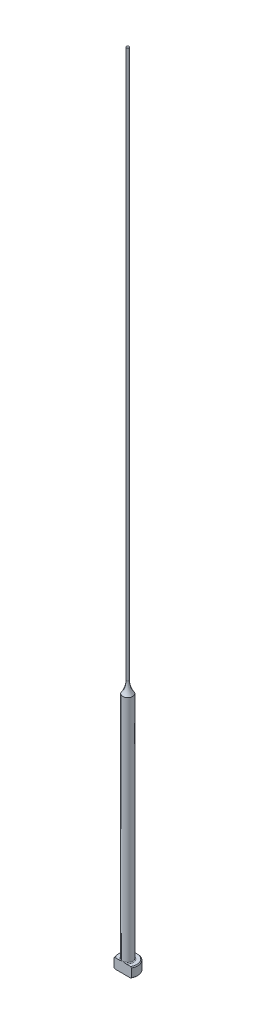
ISO-10303-21;
HEADER;
FILE_DESCRIPTION(('STEP AP214'),'2;1');
FILE_NAME('part.step','',(''),(''),'','','');
FILE_SCHEMA(('AUTOMOTIVE_DESIGN { 1 0 10303 214 1 1 1 1 }'));
ENDSEC;
DATA;
#1=APPLICATION_CONTEXT('core data for automotive mechanical design processes');
#2=APPLICATION_PROTOCOL_DEFINITION('international standard','automotive_design',2000,#1);
#3=PRODUCT_CONTEXT('',#1,'mechanical');
#4=PRODUCT('Part','Part','',(#3));
#5=PRODUCT_RELATED_PRODUCT_CATEGORY('part','',(#4));
#6=PRODUCT_DEFINITION_FORMATION('','',#4);
#7=PRODUCT_DEFINITION_CONTEXT('part definition',#1,'design');
#8=PRODUCT_DEFINITION('design','',#6,#7);
#9=PRODUCT_DEFINITION_SHAPE('','',#8);
#10=(LENGTH_UNIT() NAMED_UNIT(*) SI_UNIT(.MILLI.,.METRE.));
#11=(NAMED_UNIT(*) PLANE_ANGLE_UNIT() SI_UNIT($,.RADIAN.));
#12=(NAMED_UNIT(*) SI_UNIT($,.STERADIAN.) SOLID_ANGLE_UNIT());
#13=UNCERTAINTY_MEASURE_WITH_UNIT(LENGTH_MEASURE(1.E-05),#10,'distance_accuracy_value','');
#14=(GEOMETRIC_REPRESENTATION_CONTEXT(3) GLOBAL_UNCERTAINTY_ASSIGNED_CONTEXT((#13)) GLOBAL_UNIT_ASSIGNED_CONTEXT((#10,
#11,#12)) REPRESENTATION_CONTEXT('',''));
#15=CARTESIAN_POINT('',(0.,0.,0.));
#16=DIRECTION('',(0.,0.,1.));
#17=DIRECTION('',(1.,0.,0.));
#18=AXIS2_PLACEMENT_3D('',#15,#16,#17);
#19=CARTESIAN_POINT('',(-0.396239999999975,254.,0.));
#20=DIRECTION('',(0.,1.,0.));
#21=DIRECTION('',(0.,0.,1.));
#22=AXIS2_PLACEMENT_3D('',#19,#20,#21);
#23=PLANE('',#22);
#24=CARTESIAN_POINT('',(0.,254.,0.));
#25=DIRECTION('',(0.,1.,0.));
#26=DIRECTION('',(0.,0.,1.));
#27=AXIS2_PLACEMENT_3D('',#24,#25,#26);
#28=CIRCLE('',#27,0.396239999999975);
#29=CARTESIAN_POINT('',(0.,254.,0.396239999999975));
#30=VERTEX_POINT('',#29);
#31=EDGE_CURVE('E169',#30,#30,#28,.T.);
#32=ORIENTED_EDGE('',*,*,#31,.T.);
#33=EDGE_LOOP('',(#32));
#34=FACE_BOUND('',#33,.T.);
#35=ADVANCED_FACE('F37',(#34),#23,.T.);
#36=CARTESIAN_POINT('',(0.,259.958771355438,0.));
#37=DIRECTION('',(0.,1.,0.));
#38=DIRECTION('',(0.,0.,1.));
#39=AXIS2_PLACEMENT_3D('',#36,#37,#38);
#40=CYLINDRICAL_SURFACE('',#39,0.396239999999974);
#41=CARTESIAN_POINT('',(0.,79.9026884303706,0.));
#42=DIRECTION('',(0.,1.,0.));
#43=DIRECTION('',(0.,0.,1.));
#44=AXIS2_PLACEMENT_3D('',#41,#42,#43);
#45=CIRCLE('',#44,0.396239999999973);
#46=CARTESIAN_POINT('',(0.,79.9026884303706,0.396239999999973));
#47=VERTEX_POINT('',#46);
#48=EDGE_CURVE('E172',#47,#47,#45,.T.);
#49=ORIENTED_EDGE('',*,*,#48,.T.);
#50=EDGE_LOOP('',(#49));
#51=FACE_BOUND('',#50,.T.);
#52=ORIENTED_EDGE('',*,*,#31,.F.);
#53=EDGE_LOOP('',(#52));
#54=FACE_BOUND('',#53,.T.);
#55=ADVANCED_FACE('F160',(#51,#54),#40,.T.);
#56=CARTESIAN_POINT('',(0.,79.9026884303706,0.));
#57=DIRECTION('',(0.,1.,0.));
#58=DIRECTION('',(0.,0.,1.));
#59=AXIS2_PLACEMENT_3D('',#56,#57,#58);
#60=TOROIDAL_SURFACE('',#59,6.74623999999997,6.35);
#61=CARTESIAN_POINT('',(0.,76.2,0.));
#62=DIRECTION('',(0.,1.,0.));
#63=DIRECTION('',(0.,0.,1.));
#64=AXIS2_PLACEMENT_3D('',#61,#62,#63);
#65=CIRCLE('',#64,1.58749999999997);
#66=CARTESIAN_POINT('',(0.,76.2,1.58749999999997));
#67=VERTEX_POINT('',#66);
#68=EDGE_CURVE('E100',#67,#67,#65,.T.);
#69=ORIENTED_EDGE('',*,*,#68,.T.);
#70=EDGE_LOOP('',(#69));
#71=FACE_BOUND('',#70,.T.);
#72=ORIENTED_EDGE('',*,*,#48,.F.);
#73=EDGE_LOOP('',(#72));
#74=FACE_BOUND('',#73,.T.);
#75=ADVANCED_FACE('F165',(#71,#74),#60,.F.);
#76=CARTESIAN_POINT('',(0.,259.958771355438,0.));
#77=DIRECTION('',(0.,1.,0.));
#78=DIRECTION('',(0.,0.,1.));
#79=AXIS2_PLACEMENT_3D('',#76,#77,#78);
#80=CYLINDRICAL_SURFACE('',#79,1.58749999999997);
#81=CARTESIAN_POINT('',(0.,3.42900000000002,0.));
#82=DIRECTION('',(0.,1.,0.));
#83=DIRECTION('',(0.,0.,1.));
#84=AXIS2_PLACEMENT_3D('',#81,#82,#83);
#85=CIRCLE('',#84,1.58749999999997);
#86=CARTESIAN_POINT('',(0.,3.42900000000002,1.58749999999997));
#87=VERTEX_POINT('',#86);
#88=EDGE_CURVE('E109',#87,#87,#85,.T.);
#89=ORIENTED_EDGE('',*,*,#88,.T.);
#90=EDGE_LOOP('',(#89));
#91=FACE_BOUND('',#90,.T.);
#92=ORIENTED_EDGE('',*,*,#68,.F.);
#93=EDGE_LOOP('',(#92));
#94=FACE_BOUND('',#93,.T.);
#95=ADVANCED_FACE('F192',(#91,#94),#80,.T.);
#96=CARTESIAN_POINT('',(-3.17499999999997,3.175,0.));
#97=DIRECTION('',(0.,1.,0.));
#98=DIRECTION('',(0.,0.,1.));
#99=AXIS2_PLACEMENT_3D('',#96,#97,#98);
#100=PLANE('',#99);
#101=DIRECTION('',(-1.,0.,0.));
#102=VECTOR('',#101,1.);
#103=CARTESIAN_POINT('',(-3.17499999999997,3.175,1.58749999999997));
#104=LINE('',#103,#102);
#105=CARTESIAN_POINT('',(2.45195529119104,3.175,1.58749999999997));
#106=VERTEX_POINT('',#105);
#107=CARTESIAN_POINT('',(0.933255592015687,3.175,1.58749999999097));
#108=VERTEX_POINT('',#107);
#109=EDGE_CURVE('E58',#106,#108,#104,.T.);
#110=ORIENTED_EDGE('',*,*,#109,.F.);
#111=CARTESIAN_POINT('',(0.,3.175,0.));
#112=DIRECTION('',(0.,1.,0.));
#113=DIRECTION('',(0.,0.,1.));
#114=AXIS2_PLACEMENT_3D('',#111,#112,#113);
#115=CIRCLE('',#114,2.92099999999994);
#116=CARTESIAN_POINT('',(-2.45195529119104,3.175,1.58749999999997));
#117=VERTEX_POINT('',#116);
#118=EDGE_CURVE('E171',#106,#117,#115,.T.);
#119=ORIENTED_EDGE('',*,*,#118,.T.);
#120=CARTESIAN_POINT('',(-0.933255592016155,3.17500000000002,1.58749999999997));
#121=VERTEX_POINT('',#120);
#122=EDGE_CURVE('E140',#121,#117,#104,.T.);
#123=ORIENTED_EDGE('',*,*,#122,.F.);
#124=CARTESIAN_POINT('',(0.,3.175,0.));
#125=DIRECTION('',(0.,1.,0.));
#126=DIRECTION('',(0.,0.,1.));
#127=AXIS2_PLACEMENT_3D('',#124,#125,#126);
#128=CIRCLE('',#127,1.84149999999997);
#129=EDGE_CURVE('E113',#121,#108,#128,.F.);
#130=ORIENTED_EDGE('',*,*,#129,.T.);
#131=EDGE_LOOP('',(#110,#119,#123,#130));
#132=FACE_BOUND('',#131,.T.);
#133=ADVANCED_FACE('F189',(#132),#100,.T.);
#134=CARTESIAN_POINT('',(0.,259.958771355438,0.));
#135=DIRECTION('',(0.,1.,0.));
#136=DIRECTION('',(0.,0.,1.));
#137=AXIS2_PLACEMENT_3D('',#134,#135,#136);
#138=CYLINDRICAL_SURFACE('',#137,3.17499999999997);
#139=DIRECTION('',(0.,-1.,0.));
#140=VECTOR('',#139,1.);
#141=CARTESIAN_POINT('',(-2.74963065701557,254.,1.58749999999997));
#142=LINE('',#141,#140);
#143=CARTESIAN_POINT('',(-2.74963065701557,2.92100000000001,1.58749999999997));
#144=VERTEX_POINT('',#143);
#145=CARTESIAN_POINT('',(-2.74963065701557,0.253999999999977,1.58749999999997));
#146=VERTEX_POINT('',#145);
#147=EDGE_CURVE('E95',#144,#146,#142,.T.);
#148=ORIENTED_EDGE('',*,*,#147,.F.);
#149=CARTESIAN_POINT('',(0.,2.92100000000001,0.));
#150=DIRECTION('',(0.,1.,0.));
#151=DIRECTION('',(0.,0.,1.));
#152=AXIS2_PLACEMENT_3D('',#149,#150,#151);
#153=CIRCLE('',#152,3.17499999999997);
#154=CARTESIAN_POINT('',(2.74963065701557,2.92100000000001,1.58749999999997));
#155=VERTEX_POINT('',#154);
#156=EDGE_CURVE('E110',#144,#155,#153,.F.);
#157=ORIENTED_EDGE('',*,*,#156,.T.);
#158=DIRECTION('',(0.,-1.,0.));
#159=VECTOR('',#158,1.);
#160=CARTESIAN_POINT('',(2.74963065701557,254.,1.58749999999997));
#161=LINE('',#160,#159);
#162=CARTESIAN_POINT('',(2.74963065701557,0.253999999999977,1.58749999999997));
#163=VERTEX_POINT('',#162);
#164=EDGE_CURVE('E182',#155,#163,#161,.T.);
#165=ORIENTED_EDGE('',*,*,#164,.T.);
#166=CARTESIAN_POINT('',(0.,0.253999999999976,0.));
#167=DIRECTION('',(0.,-1.,0.));
#168=DIRECTION('',(0.,0.,-1.));
#169=AXIS2_PLACEMENT_3D('',#166,#167,#168);
#170=CIRCLE('',#169,3.17499999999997);
#171=EDGE_CURVE('E116',#163,#146,#170,.F.);
#172=ORIENTED_EDGE('',*,*,#171,.T.);
#173=EDGE_LOOP('',(#148,#157,#165,#172));
#174=FACE_BOUND('',#173,.T.);
#175=ADVANCED_FACE('F180',(#174),#138,.T.);
#176=CARTESIAN_POINT('',(0.,0.,0.));
#177=DIRECTION('',(0.,-1.,0.));
#178=DIRECTION('',(0.,0.,-1.));
#179=AXIS2_PLACEMENT_3D('',#176,#177,#178);
#180=PLANE('',#179);
#181=DIRECTION('',(1.,0.,0.));
#182=VECTOR('',#181,1.);
#183=CARTESIAN_POINT('',(-2.74963065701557,0.,1.58749999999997));
#184=LINE('',#183,#182);
#185=CARTESIAN_POINT('',(-2.45195529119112,0.,1.58749999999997));
#186=VERTEX_POINT('',#185);
#187=CARTESIAN_POINT('',(2.45195529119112,0.,1.58749999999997));
#188=VERTEX_POINT('',#187);
#189=EDGE_CURVE('E92',#186,#188,#184,.T.);
#190=ORIENTED_EDGE('',*,*,#189,.F.);
#191=CARTESIAN_POINT('',(0.,0.,0.));
#192=DIRECTION('',(0.,-1.,0.));
#193=DIRECTION('',(0.,0.,-1.));
#194=AXIS2_PLACEMENT_3D('',#191,#192,#193);
#195=CIRCLE('',#194,2.92100000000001);
#196=EDGE_CURVE('E106',#186,#188,#195,.T.);
#197=ORIENTED_EDGE('',*,*,#196,.T.);
#198=EDGE_LOOP('',(#190,#197));
#199=FACE_BOUND('',#198,.T.);
#200=ADVANCED_FACE('F105',(#199),#180,.T.);
#201=CARTESIAN_POINT('',(0.,3.17499999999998,0.));
#202=DIRECTION('',(0.,-1.,0.));
#203=DIRECTION('',(0.,0.,-1.));
#204=AXIS2_PLACEMENT_3D('',#201,#202,#203);
#205=CONICAL_SURFACE('',#204,2.92099999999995,0.785398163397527);
#206=CARTESIAN_POINT('',(6.0529050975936,-0.16162066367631,1.58749999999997));
#207=CARTESIAN_POINT('',(5.91567682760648,-0.0288893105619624,1.58749999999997));
#208=CARTESIAN_POINT('',(5.7783103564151,0.103699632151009,1.58749999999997));
#209=CARTESIAN_POINT('',(5.50321874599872,0.368508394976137,1.58749999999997));
#210=CARTESIAN_POINT('',(5.36549360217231,0.500728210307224,1.58749999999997));
#211=CARTESIAN_POINT('',(5.08953516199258,0.764778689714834,1.58749999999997));
#212=CARTESIAN_POINT('',(4.9513016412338,0.896609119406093,1.58749999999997));
#213=CARTESIAN_POINT('',(4.67428233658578,1.15968706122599,1.58749999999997));
#214=CARTESIAN_POINT('',(4.53549655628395,1.29093457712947,1.58749999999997));
#215=CARTESIAN_POINT('',(4.25997724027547,1.55007705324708,1.58749999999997));
#216=CARTESIAN_POINT('',(4.12325766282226,1.67798684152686,1.58749999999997));
#217=CARTESIAN_POINT('',(3.84892898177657,1.9328486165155,1.58749999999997));
#218=CARTESIAN_POINT('',(3.71131988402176,2.05980060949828,1.58749999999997));
#219=CARTESIAN_POINT('',(3.43493978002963,2.31237508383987,1.58749999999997));
#220=CARTESIAN_POINT('',(3.29616903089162,2.43799784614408,1.58749999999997));
#221=CARTESIAN_POINT('',(3.01699558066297,2.68741369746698,1.58749999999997));
#222=CARTESIAN_POINT('',(2.8765929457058,2.81120686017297,1.58749999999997));
#223=CARTESIAN_POINT('',(2.64816703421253,3.00875865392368,1.58749999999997));
#224=CARTESIAN_POINT('',(2.56087478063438,3.08336151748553,1.58749999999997));
#225=CARTESIAN_POINT('',(2.38515423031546,3.23123871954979,1.58749999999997));
#226=CARTESIAN_POINT('',(2.29672582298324,3.30451292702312,1.58749999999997));
#227=CARTESIAN_POINT('',(2.11747400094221,3.45004422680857,1.58749999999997));
#228=CARTESIAN_POINT('',(2.02663514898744,3.5222823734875,1.58749999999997));
#229=CARTESIAN_POINT('',(1.8430252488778,3.66423097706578,1.58749999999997));
#230=CARTESIAN_POINT('',(1.75025467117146,3.73394203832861,1.58749999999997));
#231=CARTESIAN_POINT('',(1.56067475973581,3.87080633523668,1.58749999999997));
#232=CARTESIAN_POINT('',(1.46382547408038,3.93790459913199,1.58749999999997));
#233=CARTESIAN_POINT('',(1.26632594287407,4.06669147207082,1.58749999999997));
#234=CARTESIAN_POINT('',(1.16567073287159,4.1283726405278,1.58749999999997));
#235=CARTESIAN_POINT('',(1.01165766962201,4.21402252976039,1.58749999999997));
#236=CARTESIAN_POINT('',(0.960142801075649,4.24127929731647,1.58749999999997));
#237=CARTESIAN_POINT('',(0.855780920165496,4.2930979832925,1.58749999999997));
#238=CARTESIAN_POINT('',(0.80293366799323,4.31765941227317,1.58749999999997));
#239=CARTESIAN_POINT('',(0.642461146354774,4.38614656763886,1.58749999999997));
#240=CARTESIAN_POINT('',(0.532518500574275,4.42510149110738,1.58749999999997));
#241=CARTESIAN_POINT('',(0.367680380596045,4.46726244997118,1.58749999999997));
#242=CARTESIAN_POINT('',(0.31480288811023,4.47844427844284,1.58749999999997));
#243=CARTESIAN_POINT('',(0.208209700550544,4.49576654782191,1.58749999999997));
#244=CARTESIAN_POINT('',(0.154494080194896,4.50190743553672,1.58749999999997));
#245=CARTESIAN_POINT('',(0.0468792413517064,4.50871296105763,1.58749999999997));
#246=CARTESIAN_POINT('',(-0.0070188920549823,4.5093945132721,1.58749999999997));
#247=CARTESIAN_POINT('',(-0.114606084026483,4.50527679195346,1.58749999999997));
#248=CARTESIAN_POINT('',(-0.168295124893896,4.50047706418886,1.58749999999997));
#249=CARTESIAN_POINT('',(-0.274485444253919,4.48579689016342,1.58749999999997));
#250=CARTESIAN_POINT('',(-0.326992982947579,4.47596081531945,1.58749999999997));
#251=CARTESIAN_POINT('',(-0.430974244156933,4.45181809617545,1.58749999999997));
#252=CARTESIAN_POINT('',(-0.482447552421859,4.4375096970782,1.58749999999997));
#253=CARTESIAN_POINT('',(-0.584460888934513,4.40502489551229,1.58749999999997));
#254=CARTESIAN_POINT('',(-0.634994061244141,4.386827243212,1.58749999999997));
#255=CARTESIAN_POINT('',(-0.734789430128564,4.34729308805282,1.58749999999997));
#256=CARTESIAN_POINT('',(-0.784051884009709,4.3259572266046,1.58749999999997));
#257=CARTESIAN_POINT('',(-0.930549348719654,4.25791922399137,1.58749999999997));
#258=CARTESIAN_POINT('',(-1.0259880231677,4.20736047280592,1.58749999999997));
#259=CARTESIAN_POINT('',(-1.21304313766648,4.0995545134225,1.58749999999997));
#260=CARTESIAN_POINT('',(-1.30465471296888,4.04229912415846,1.58749999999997));
#261=CARTESIAN_POINT('',(-1.48526211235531,3.92308746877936,1.58749999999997));
#262=CARTESIAN_POINT('',(-1.57424615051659,3.86111349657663,1.58749999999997));
#263=CARTESIAN_POINT('',(-1.74990003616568,3.73408621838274,1.58749999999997));
#264=CARTESIAN_POINT('',(-1.83657099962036,3.66903444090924,1.58749999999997));
#265=CARTESIAN_POINT('',(-2.00931764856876,3.53583371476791,1.58749999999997));
#266=CARTESIAN_POINT('',(-2.09537048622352,3.46765527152,1.58749999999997));
#267=CARTESIAN_POINT('',(-2.26611736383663,3.32960643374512,1.58749999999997));
#268=CARTESIAN_POINT('',(-2.35081125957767,3.25973586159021,1.58749999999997));
#269=CARTESIAN_POINT('',(-2.60290121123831,3.04858139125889,1.58749999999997));
#270=CARTESIAN_POINT('',(-2.76872537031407,2.90542388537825,1.58749999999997));
#271=CARTESIAN_POINT('',(-3.06970913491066,2.64069522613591,1.58749999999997));
#272=CARTESIAN_POINT('',(-3.20528660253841,2.51959458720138,1.58749999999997));
#273=CARTESIAN_POINT('',(-3.47510321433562,2.27590400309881,1.58749999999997));
#274=CARTESIAN_POINT('',(-3.60934232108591,2.1533140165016,1.58749999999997));
#275=CARTESIAN_POINT('',(-3.87695374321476,1.90694239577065,1.58749999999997));
#276=CARTESIAN_POINT('',(-4.0103251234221,1.78315974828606,1.58749999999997));
#277=CARTESIAN_POINT('',(-4.27630880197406,1.53478104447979,1.58749999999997));
#278=CARTESIAN_POINT('',(-4.40892109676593,1.41018498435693,1.58749999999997));
#279=CARTESIAN_POINT('',(-4.79499418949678,1.0457468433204,1.58749999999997));
#280=CARTESIAN_POINT('',(-5.04767313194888,0.805076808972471,1.58749999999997));
#281=CARTESIAN_POINT('',(-5.42550911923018,0.443121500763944,1.58749999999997));
#282=CARTESIAN_POINT('',(-5.55118772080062,0.322378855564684,1.58749999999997));
#283=CARTESIAN_POINT('',(-5.80225207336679,0.0805914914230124,1.58749999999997));
#284=CARTESIAN_POINT('',(-5.92763782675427,-0.0404532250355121,1.58749999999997));
#285=CARTESIAN_POINT('',(-6.0529050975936,-0.161620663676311,1.58749999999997));
#286=B_SPLINE_CURVE_WITH_KNOTS('',3,(#206,#207,#208,#209,#210,#211,#212,#213,#214,#215,#216,
#217,#218,#219,#220,#221,#222,#223,#224,#225,#226,#227,#228,#229,#230,#231,#232,#233,#234,#235,
#236,#237,#238,#239,#240,#241,#242,#243,#244,#245,#246,#247,#248,#249,#250,#251,#252,#253,#254,
#255,#256,#257,#258,#259,#260,#261,#262,#263,#264,#265,#266,#267,#268,#269,#270,#271,#272,#273,
#274,#275,#276,#277,#278,#279,#280,#281,#282,#283,#284,#285),.UNSPECIFIED.,.F.,.F.,(4,2,2,2,2,2,
2,2,2,2,2,2,2,2,2,2,2,2,2,2,2,2,2,2,2,2,2,2,2,2,2,2,2,2,2,2,2,2,2,4),(0.,0.572750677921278,
1.14550874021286,1.71856057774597,2.29160869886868,2.85328006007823,3.4149477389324,
3.97649423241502,4.53801804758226,4.88249307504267,5.22700189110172,5.5751532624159,
5.92322081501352,6.27657800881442,6.63041319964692,6.80518126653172,6.9799810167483,
7.3282426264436,7.49018491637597,7.65211285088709,7.81353889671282,7.97497832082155,
8.13501929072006,8.29512313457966,8.45612518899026,8.61709438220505,8.94062993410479,
9.2645649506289,9.58978187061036,9.91483894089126,10.2441741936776,10.5735441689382,
11.2306812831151,11.7760337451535,12.3214014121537,12.8672825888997,13.4131663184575,
14.4600164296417,14.9828595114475,15.5056983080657),.UNSPECIFIED.);
#287=EDGE_CURVE('E63',#155,#106,#286,.T.);
#288=ORIENTED_EDGE('',*,*,#287,.F.);
#289=ORIENTED_EDGE('',*,*,#156,.F.);
#290=EDGE_CURVE('E133',#117,#144,#286,.T.);
#291=ORIENTED_EDGE('',*,*,#290,.F.);
#292=ORIENTED_EDGE('',*,*,#118,.F.);
#293=EDGE_LOOP('',(#288,#289,#291,#292));
#294=FACE_BOUND('',#293,.T.);
#295=ADVANCED_FACE('F147',(#294),#205,.T.);
#296=CARTESIAN_POINT('',(0.,0.253999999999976,0.));
#297=DIRECTION('',(0.,1.,0.));
#298=DIRECTION('',(0.,0.,1.));
#299=AXIS2_PLACEMENT_3D('',#296,#297,#298);
#300=CONICAL_SURFACE('',#299,3.17499999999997,0.785398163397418);
#301=CARTESIAN_POINT('',(-6.0529050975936,3.33662066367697,1.58749999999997));
#302=CARTESIAN_POINT('',(-5.91567682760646,3.20388931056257,1.58749999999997));
#303=CARTESIAN_POINT('',(-5.77831035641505,3.07130036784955,1.58749999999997));
#304=CARTESIAN_POINT('',(-5.50321874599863,2.80649160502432,1.58749999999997));
#305=CARTESIAN_POINT('',(-5.3654936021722,2.67427178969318,1.58749999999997));
#306=CARTESIAN_POINT('',(-5.08953516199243,2.41022131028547,1.58749999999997));
#307=CARTESIAN_POINT('',(-4.95130164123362,2.27839088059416,1.58749999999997));
#308=CARTESIAN_POINT('',(-4.67428233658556,2.01531293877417,1.58749999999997));
#309=CARTESIAN_POINT('',(-4.5354965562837,1.88406542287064,1.58749999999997));
#310=CARTESIAN_POINT('',(-4.25997724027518,1.62492294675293,1.58749999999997));
#311=CARTESIAN_POINT('',(-4.12325766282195,1.49701315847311,1.58749999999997));
#312=CARTESIAN_POINT('',(-3.84892898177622,1.24215138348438,1.58749999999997));
#313=CARTESIAN_POINT('',(-3.71131988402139,1.11519939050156,1.58749999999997));
#314=CARTESIAN_POINT('',(-3.43493978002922,0.862624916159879,1.58749999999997));
#315=CARTESIAN_POINT('',(-3.29616903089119,0.737002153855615,1.58749999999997));
#316=CARTESIAN_POINT('',(-3.01699558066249,0.487586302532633,1.58749999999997));
#317=CARTESIAN_POINT('',(-2.8765929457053,0.363793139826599,1.58749999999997));
#318=CARTESIAN_POINT('',(-2.64816703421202,0.166241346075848,1.58749999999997));
#319=CARTESIAN_POINT('',(-2.56087478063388,0.0916384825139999,1.58749999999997));
#320=CARTESIAN_POINT('',(-2.385154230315,-0.0562387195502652,1.58749999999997));
#321=CARTESIAN_POINT('',(-2.29672582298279,-0.129512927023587,1.58749999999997));
#322=CARTESIAN_POINT('',(-2.11747400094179,-0.275044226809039,1.58749999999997));
#323=CARTESIAN_POINT('',(-2.02663514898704,-0.347282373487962,1.58749999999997));
#324=CARTESIAN_POINT('',(-1.84302524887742,-0.489230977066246,1.58749999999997));
#325=CARTESIAN_POINT('',(-1.7502546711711,-0.558942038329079,1.58749999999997));
#326=CARTESIAN_POINT('',(-1.56067475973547,-0.695806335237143,1.58749999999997));
#327=CARTESIAN_POINT('',(-1.46382547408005,-0.762904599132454,1.58749999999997));
#328=CARTESIAN_POINT('',(-1.26632594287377,-0.891691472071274,1.58749999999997));
#329=CARTESIAN_POINT('',(-1.16567073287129,-0.953372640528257,1.58749999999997));
#330=CARTESIAN_POINT('',(-1.01165766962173,-1.03902252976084,1.58749999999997));
#331=CARTESIAN_POINT('',(-0.960142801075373,-1.06627929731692,1.58749999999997));
#332=CARTESIAN_POINT('',(-0.85578092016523,-1.11809798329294,1.58749999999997));
#333=CARTESIAN_POINT('',(-0.802933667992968,-1.14265941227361,1.58749999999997));
#334=CARTESIAN_POINT('',(-0.642461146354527,-1.21114656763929,1.58749999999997));
#335=CARTESIAN_POINT('',(-0.532518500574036,-1.2501014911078,1.58749999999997));
#336=CARTESIAN_POINT('',(-0.367680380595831,-1.29226244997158,1.58749999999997));
#337=CARTESIAN_POINT('',(-0.314802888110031,-1.30344427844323,1.58749999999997));
#338=CARTESIAN_POINT('',(-0.208209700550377,-1.32076654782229,1.58749999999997));
#339=CARTESIAN_POINT('',(-0.154494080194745,-1.3269074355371,1.58749999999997));
#340=CARTESIAN_POINT('',(-0.0468792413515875,-1.333712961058,1.58749999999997));
#341=CARTESIAN_POINT('',(0.00701889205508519,-1.33439451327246,1.58749999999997));
#342=CARTESIAN_POINT('',(0.114606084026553,-1.33027679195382,1.58749999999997));
#343=CARTESIAN_POINT('',(0.16829512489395,-1.32547706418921,1.58749999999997));
#344=CARTESIAN_POINT('',(0.274485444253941,-1.31079689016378,1.58749999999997));
#345=CARTESIAN_POINT('',(0.326992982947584,-1.3009608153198,1.58749999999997));
#346=CARTESIAN_POINT('',(0.430974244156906,-1.27681809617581,1.58749999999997));
#347=CARTESIAN_POINT('',(0.482447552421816,-1.26250969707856,1.58749999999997));
#348=CARTESIAN_POINT('',(0.584460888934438,-1.23002489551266,1.58749999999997));
#349=CARTESIAN_POINT('',(0.634994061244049,-1.21182724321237,1.58749999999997));
#350=CARTESIAN_POINT('',(0.734789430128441,-1.1722930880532,1.58749999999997));
#351=CARTESIAN_POINT('',(0.784051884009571,-1.15095722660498,1.58749999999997));
#352=CARTESIAN_POINT('',(0.93054934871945,-1.08291922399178,1.58749999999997));
#353=CARTESIAN_POINT('',(1.02598802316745,-1.03236047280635,1.58749999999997));
#354=CARTESIAN_POINT('',(1.21304313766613,-0.924554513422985,1.58749999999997));
#355=CARTESIAN_POINT('',(1.30465471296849,-0.86729912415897,1.58749999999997));
#356=CARTESIAN_POINT('',(1.48526211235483,-0.748087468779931,1.58749999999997));
#357=CARTESIAN_POINT('',(1.57424615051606,-0.686113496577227,1.58749999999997));
#358=CARTESIAN_POINT('',(1.74990003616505,-0.559086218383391,1.58749999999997));
#359=CARTESIAN_POINT('',(1.83657099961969,-0.494034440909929,1.58749999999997));
#360=CARTESIAN_POINT('',(2.009317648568,-0.360833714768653,1.58749999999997));
#361=CARTESIAN_POINT('',(2.09537048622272,-0.292655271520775,1.58749999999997));
#362=CARTESIAN_POINT('',(2.26611736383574,-0.154606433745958,1.58749999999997));
#363=CARTESIAN_POINT('',(2.35081125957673,-0.0847358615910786,1.58749999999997));
#364=CARTESIAN_POINT('',(2.60290121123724,0.126418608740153,1.58749999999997));
#365=CARTESIAN_POINT('',(2.7687253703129,0.269576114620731,1.58749999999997));
#366=CARTESIAN_POINT('',(3.06970913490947,0.534304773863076,1.58749999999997));
#367=CARTESIAN_POINT('',(3.20528660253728,0.65540541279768,1.58749999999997));
#368=CARTESIAN_POINT('',(3.47510321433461,0.899095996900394,1.58749999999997));
#369=CARTESIAN_POINT('',(3.60934232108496,1.02168598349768,1.58749999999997));
#370=CARTESIAN_POINT('',(3.87695374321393,1.26805760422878,1.58749999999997));
#371=CARTESIAN_POINT('',(4.01032512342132,1.39184025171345,1.58749999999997));
#372=CARTESIAN_POINT('',(4.2763088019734,1.64021895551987,1.58749999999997));
#373=CARTESIAN_POINT('',(4.40892109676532,1.76481501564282,1.58749999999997));
#374=CARTESIAN_POINT('',(4.79499418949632,2.12925315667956,1.58749999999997));
#375=CARTESIAN_POINT('',(5.04767313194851,2.36992319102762,1.58749999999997));
#376=CARTESIAN_POINT('',(5.42550911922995,2.73187849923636,1.58749999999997));
#377=CARTESIAN_POINT('',(5.55118772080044,2.85262114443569,1.58749999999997));
#378=CARTESIAN_POINT('',(5.8022520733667,3.0944085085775,1.58749999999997));
#379=CARTESIAN_POINT('',(5.92763782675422,3.2154532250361,1.58749999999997));
#380=CARTESIAN_POINT('',(6.0529050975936,3.33662066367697,1.58749999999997));
#381=B_SPLINE_CURVE_WITH_KNOTS('',3,(#301,#302,#303,#304,#305,#306,#307,#308,#309,#310,#311,
#312,#313,#314,#315,#316,#317,#318,#319,#320,#321,#322,#323,#324,#325,#326,#327,#328,#329,#330,
#331,#332,#333,#334,#335,#336,#337,#338,#339,#340,#341,#342,#343,#344,#345,#346,#347,#348,#349,
#350,#351,#352,#353,#354,#355,#356,#357,#358,#359,#360,#361,#362,#363,#364,#365,#366,#367,#368,
#369,#370,#371,#372,#373,#374,#375,#376,#377,#378,#379,#380),.UNSPECIFIED.,.F.,.F.,(4,2,2,2,2,2,
2,2,2,2,2,2,2,2,2,2,2,2,2,2,2,2,2,2,2,2,2,2,2,2,2,2,2,2,2,2,2,2,2,4),(0.,0.57275067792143,
1.14550874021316,1.71856057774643,2.29160869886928,2.85328006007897,3.41494773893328,
3.97649423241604,4.53801804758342,4.88249307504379,5.2270018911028,5.57515326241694,
5.92322081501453,6.27657800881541,6.63041319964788,6.80518126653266,6.97998101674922,
7.32824262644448,7.49018491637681,7.65211285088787,7.81353889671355,7.97497832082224,
8.1350192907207,8.29512313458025,8.4561251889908,8.61709438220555,8.94062993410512,
9.26456495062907,9.58978187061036,9.91483894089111,10.2441741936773,10.5735441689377,
11.2306812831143,11.7760337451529,12.3214014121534,12.8672825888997,13.4131663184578,
14.4600164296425,14.9828595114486,15.505698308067),.UNSPECIFIED.);
#382=EDGE_CURVE('E89',#146,#186,#381,.T.);
#383=ORIENTED_EDGE('',*,*,#382,.F.);
#384=ORIENTED_EDGE('',*,*,#171,.F.);
#385=EDGE_CURVE('E101',#188,#163,#381,.T.);
#386=ORIENTED_EDGE('',*,*,#385,.F.);
#387=ORIENTED_EDGE('',*,*,#196,.F.);
#388=EDGE_LOOP('',(#383,#384,#386,#387));
#389=FACE_BOUND('',#388,.T.);
#390=ADVANCED_FACE('F108',(#389),#300,.T.);
#391=CARTESIAN_POINT('',(0.,3.42900000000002,0.));
#392=DIRECTION('',(0.,1.,0.));
#393=DIRECTION('',(0.,0.,1.));
#394=AXIS2_PLACEMENT_3D('',#391,#392,#393);
#395=TOROIDAL_SURFACE('',#394,1.84149999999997,0.254);
#396=ORIENTED_EDGE('',*,*,#129,.F.);
#397=CARTESIAN_POINT('',(0.,3.42900000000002,1.58749999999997));
#398=CARTESIAN_POINT('',(-1.9220503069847E-10,3.42900057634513,1.58749999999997));
#399=CARTESIAN_POINT('',(-1.22611612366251E-07,3.42900115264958,1.58749999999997));
#400=CARTESIAN_POINT('',(-5.09676358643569E-07,3.42900226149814,1.58749999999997));
#401=CARTESIAN_POINT('',(-7.78176319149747E-07,3.42900279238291,1.58749999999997));
#402=CARTESIAN_POINT('',(-1.42307271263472E-06,3.42900385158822,1.58749999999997));
#403=CARTESIAN_POINT('',(-1.80713865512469E-06,3.42900437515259,1.58749999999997));
#404=CARTESIAN_POINT('',(-2.63494844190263E-06,3.42900536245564,1.58749999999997));
#405=CARTESIAN_POINT('',(-3.07814754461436E-06,3.42900582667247,1.58749999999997));
#406=CARTESIAN_POINT('',(-4.66897354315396E-06,3.42900738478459,1.58749999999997));
#407=CARTESIAN_POINT('',(-5.8940490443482E-06,3.42900840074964,1.58749999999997));
#408=CARTESIAN_POINT('',(-8.42427506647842E-06,3.42901020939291,1.58749999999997));
#409=CARTESIAN_POINT('',(-9.72480570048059E-06,3.42901100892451,1.58749999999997));
#410=CARTESIAN_POINT('',(-1.48060601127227E-05,3.42901401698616,1.58749999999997));
#411=CARTESIAN_POINT('',(-1.86838280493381E-05,3.42901606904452,1.58749999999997));
#412=CARTESIAN_POINT('',(-2.63261116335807E-05,3.42901942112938,1.58749999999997));
#413=CARTESIAN_POINT('',(-3.00687416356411E-05,3.42902077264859,1.58749999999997));
#414=CARTESIAN_POINT('',(-4.60276297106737E-05,3.42902652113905,1.58749999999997));
#415=CARTESIAN_POINT('',(-5.82470196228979E-05,3.4290308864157,1.58749999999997));
#416=CARTESIAN_POINT('',(-8.11070094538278E-05,3.42903788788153,1.58749999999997));
#417=CARTESIAN_POINT('',(-9.16953111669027E-05,3.42904068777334,1.58749999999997));
#418=CARTESIAN_POINT('',(-0.000168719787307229,3.42906287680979,1.58749999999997));
#419=CARTESIAN_POINT('',(-0.000232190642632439,3.42909118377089,1.58749999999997));
#420=CARTESIAN_POINT('',(-0.000479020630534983,3.42919723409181,1.58749999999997));
#421=CARTESIAN_POINT('',(-0.000664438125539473,3.42926834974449,1.58749999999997));
#422=CARTESIAN_POINT('',(-0.00138448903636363,3.42954862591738,1.58749999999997));
#423=CARTESIAN_POINT('',(-0.00191701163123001,3.42976473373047,1.58749999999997));
#424=CARTESIAN_POINT('',(-0.00409774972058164,3.43064550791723,1.58749999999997));
#425=CARTESIAN_POINT('',(-0.00574830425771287,3.43130231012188,1.58749999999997));
#426=CARTESIAN_POINT('',(-0.028998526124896,3.44055947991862,1.58749999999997));
#427=CARTESIAN_POINT('',(-0.050581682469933,3.44921674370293,1.58749999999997));
#428=CARTESIAN_POINT('',(-0.0929947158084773,3.46610702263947,1.58749999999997));
#429=CARTESIAN_POINT('',(-0.113823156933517,3.4743439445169,1.58749999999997));
#430=CARTESIAN_POINT('',(-0.157956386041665,3.49164606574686,1.58749999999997));
#431=CARTESIAN_POINT('',(-0.181267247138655,3.50069608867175,1.58749999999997));
#432=CARTESIAN_POINT('',(-0.228222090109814,3.51863224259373,1.58749999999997));
#433=CARTESIAN_POINT('',(-0.25186705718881,3.52751579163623,1.58749999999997));
#434=CARTESIAN_POINT('',(-0.310512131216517,3.54905503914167,1.58749999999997));
#435=CARTESIAN_POINT('',(-0.345588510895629,3.56150550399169,1.58749999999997));
#436=CARTESIAN_POINT('',(-0.415278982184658,3.58503024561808,1.58749999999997));
#437=CARTESIAN_POINT('',(-0.449884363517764,3.59613012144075,1.58749999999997));
#438=CARTESIAN_POINT('',(-0.52447121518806,3.61841679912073,1.58749999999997));
#439=CARTESIAN_POINT('',(-0.564517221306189,3.62939137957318,1.58749999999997));
#440=CARTESIAN_POINT('',(-0.645529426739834,3.6489746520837,1.58749999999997));
#441=CARTESIAN_POINT('',(-0.686500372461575,3.65756417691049,1.58749999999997));
#442=CARTESIAN_POINT('',(-0.771546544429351,3.67188287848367,1.58749999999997));
#443=CARTESIAN_POINT('',(-0.815658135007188,3.67740449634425,1.58749999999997));
#444=CARTESIAN_POINT('',(-0.904117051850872,3.68344603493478,1.58749999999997));
#445=CARTESIAN_POINT('',(-0.948462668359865,3.68398638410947,1.58749999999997));
#446=CARTESIAN_POINT('',(-1.02531896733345,3.67901051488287,1.58749999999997));
#447=CARTESIAN_POINT('',(-1.05792141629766,3.67502604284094,1.58749999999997));
#448=CARTESIAN_POINT('',(-1.12184393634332,3.6623083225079,1.58749999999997));
#449=CARTESIAN_POINT('',(-1.15317534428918,3.65363950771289,1.58749999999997));
#450=CARTESIAN_POINT('',(-1.19946468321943,3.63563847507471,1.58749999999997));
#451=CARTESIAN_POINT('',(-1.2152678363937,3.62848492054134,1.58749999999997));
#452=CARTESIAN_POINT('',(-1.24583726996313,3.61212937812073,1.58749999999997));
#453=CARTESIAN_POINT('',(-1.26060215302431,3.60292469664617,1.58749999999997));
#454=CARTESIAN_POINT('',(-1.28575815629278,3.58421518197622,1.58749999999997));
#455=CARTESIAN_POINT('',(-1.29644383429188,3.57510998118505,1.58749999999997));
#456=CARTESIAN_POINT('',(-1.31623154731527,3.55531539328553,1.58749999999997));
#457=CARTESIAN_POINT('',(-1.32533681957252,3.54462932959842,1.58749999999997));
#458=CARTESIAN_POINT('',(-1.33941140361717,3.52450022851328,1.58749999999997));
#459=CARTESIAN_POINT('',(-1.34484814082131,3.51538553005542,1.58749999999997));
#460=CARTESIAN_POINT('',(-1.35416329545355,3.49638544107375,1.58749999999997));
#461=CARTESIAN_POINT('',(-1.35804267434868,3.48650053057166,1.58749999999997));
#462=CARTESIAN_POINT('',(-1.36398436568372,3.46611321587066,1.58749999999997));
#463=CARTESIAN_POINT('',(-1.36603350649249,3.45560690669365,1.58749999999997));
#464=CARTESIAN_POINT('',(-1.3680840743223,3.43439627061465,1.58749999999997));
#465=CARTESIAN_POINT('',(-1.36808648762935,3.42369204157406,1.58749999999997));
#466=CARTESIAN_POINT('',(-1.36616208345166,3.40366716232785,1.58749999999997));
#467=CARTESIAN_POINT('',(-1.36444960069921,3.39432493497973,1.58749999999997));
#468=CARTESIAN_POINT('',(-1.35953338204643,3.37604480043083,1.58749999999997));
#469=CARTESIAN_POINT('',(-1.3563294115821,3.36710695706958,1.58749999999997));
#470=CARTESIAN_POINT('',(-1.34848006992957,3.34949697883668,1.58749999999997));
#471=CARTESIAN_POINT('',(-1.34378578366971,3.34084688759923,1.58749999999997));
#472=CARTESIAN_POINT('',(-1.33324445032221,3.32428742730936,1.58749999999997));
#473=CARTESIAN_POINT('',(-1.32739692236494,3.3163783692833,1.58749999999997));
#474=CARTESIAN_POINT('',(-1.3110730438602,3.29692878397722,1.58749999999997));
#475=CARTESIAN_POINT('',(-1.29989286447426,3.28597778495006,1.58749999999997));
#476=CARTESIAN_POINT('',(-1.27593566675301,3.26597490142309,1.58749999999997));
#477=CARTESIAN_POINT('',(-1.26315370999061,3.25692913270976,1.58749999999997));
#478=CARTESIAN_POINT('',(-1.2293073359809,3.23613976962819,1.58749999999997));
#479=CARTESIAN_POINT('',(-1.20751096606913,3.225594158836,1.58749999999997));
#480=CARTESIAN_POINT('',(-1.16266144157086,3.20795356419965,1.58749999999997));
#481=CARTESIAN_POINT('',(-1.13960937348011,3.20085564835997,1.58749999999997));
#482=CARTESIAN_POINT('',(-1.07603916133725,3.18534571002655,1.58749999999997));
#483=CARTESIAN_POINT('',(-1.03486686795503,3.17965078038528,1.58749999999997));
#484=CARTESIAN_POINT('',(-0.951558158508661,3.1741711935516,1.58749999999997));
#485=CARTESIAN_POINT('',(-0.909417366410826,3.17449023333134,1.58749999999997));
#486=CARTESIAN_POINT('',(-0.811383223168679,3.18054602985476,1.58749999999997));
#487=CARTESIAN_POINT('',(-0.755610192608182,3.18806126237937,1.58749999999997));
#488=CARTESIAN_POINT('',(-0.644937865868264,3.20866626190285,1.58749999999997));
#489=CARTESIAN_POINT('',(-0.590043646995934,3.22178102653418,1.58749999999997));
#490=CARTESIAN_POINT('',(-0.485757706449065,3.25059077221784,1.58749999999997));
#491=CARTESIAN_POINT('',(-0.43628165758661,3.26598903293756,1.58749999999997));
#492=CARTESIAN_POINT('',(-0.338551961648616,3.29877502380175,1.58749999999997));
#493=CARTESIAN_POINT('',(-0.290291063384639,3.3161415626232,1.58749999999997));
#494=CARTESIAN_POINT('',(-0.225557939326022,3.34039762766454,1.58749999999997));
#495=CARTESIAN_POINT('',(-0.208874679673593,3.34673586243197,1.58749999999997));
#496=CARTESIAN_POINT('',(-0.175123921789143,3.35969957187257,1.58749999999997));
#497=CARTESIAN_POINT('',(-0.158057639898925,3.36632823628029,1.58749999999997));
#498=CARTESIAN_POINT('',(-0.117638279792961,3.38214476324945,1.58749999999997));
#499=CARTESIAN_POINT('',(-0.0943002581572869,3.39137029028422,1.58749999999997));
#500=CARTESIAN_POINT('',(-0.0497824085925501,3.40910304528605,1.58749999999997));
#501=CARTESIAN_POINT('',(-0.0285986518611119,3.41759960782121,1.58749999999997));
#502=CARTESIAN_POINT('',(-0.00575168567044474,3.42669635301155,1.58749999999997));
#503=CARTESIAN_POINT('',(-0.00410451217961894,3.42735181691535,1.58749999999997));
#504=CARTESIAN_POINT('',(-0.00192459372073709,3.4282322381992,1.58749999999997));
#505=CARTESIAN_POINT('',(-0.00138952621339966,3.42844937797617,1.58749999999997));
#506=CARTESIAN_POINT('',(-0.00066624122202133,3.42873091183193,1.58749999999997));
#507=CARTESIAN_POINT('',(-0.000480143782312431,3.4288022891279,1.58749999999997));
#508=CARTESIAN_POINT('',(-0.000232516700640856,3.4289086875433,1.58749999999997));
#509=CARTESIAN_POINT('',(-0.000168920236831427,3.42893705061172,1.58749999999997));
#510=CARTESIAN_POINT('',(-9.17527159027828E-05,3.42895927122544,1.58749999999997));
#511=CARTESIAN_POINT('',(-8.11550290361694E-05,3.4289620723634,1.58749999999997));
#512=CARTESIAN_POINT('',(-5.82743946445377E-05,3.42896908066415,1.58749999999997));
#513=CARTESIAN_POINT('',(-4.60439999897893E-05,3.42897345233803,1.58749999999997));
#514=CARTESIAN_POINT('',(-3.00727681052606E-05,3.42897920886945,1.58749999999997));
#515=CARTESIAN_POINT('',(-2.63286806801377E-05,3.42898056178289,1.58749999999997));
#516=CARTESIAN_POINT('',(-1.8683652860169E-05,3.42898391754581,1.58749999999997));
#517=CARTESIAN_POINT('',(-1.48046516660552E-05,3.42898597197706,1.58749999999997));
#518=CARTESIAN_POINT('',(-9.72223939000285E-06,3.42898898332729,1.58749999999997));
#519=CARTESIAN_POINT('',(-8.42159644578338E-06,3.42898978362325,1.58749999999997));
#520=CARTESIAN_POINT('',(-5.89129725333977E-06,3.4289915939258,1.58749999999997));
#521=CARTESIAN_POINT('',(-4.6662686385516E-06,3.42899261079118,1.58749999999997));
#522=CARTESIAN_POINT('',(-3.07568801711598E-06,3.42899417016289,1.58749999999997));
#523=CARTESIAN_POINT('',(-2.63259563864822E-06,3.42899463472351,1.58749999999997));
#524=CARTESIAN_POINT('',(-1.80506084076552E-06,3.42899562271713,1.58749999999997));
#525=CARTESIAN_POINT('',(-1.42116386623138E-06,3.42899614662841,1.58749999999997));
#526=CARTESIAN_POINT('',(-7.76675634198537E-07,3.42899720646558,1.58749999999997));
#527=CARTESIAN_POINT('',(-5.08406481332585E-07,3.42899773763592,1.58749999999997));
#528=CARTESIAN_POINT('',(-1.21901884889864E-07,3.42899884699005,1.58749999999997));
#529=CARTESIAN_POINT('',(1.92251560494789E-10,3.42899942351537,1.58749999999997));
#530=CARTESIAN_POINT('',(0.,3.42900000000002,1.58749999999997));
#531=B_SPLINE_CURVE_WITH_KNOTS('',3,(#397,#398,#399,#400,#401,#402,#403,#404,#405,#406,#407,
#408,#409,#410,#411,#412,#413,#414,#415,#416,#417,#418,#419,#420,#421,#422,#423,#424,#425,#426,
#427,#428,#429,#430,#431,#432,#433,#434,#435,#436,#437,#438,#439,#440,#441,#442,#443,#444,#445,
#446,#447,#448,#449,#450,#451,#452,#453,#454,#455,#456,#457,#458,#459,#460,#461,#462,#463,#464,
#465,#466,#467,#468,#469,#470,#471,#472,#473,#474,#475,#476,#477,#478,#479,#480,#481,#482,#483,
#484,#485,#486,#487,#488,#489,#490,#491,#492,#493,#494,#495,#496,#497,#498,#499,#500,#501,#502,
#503,#504,#505,#506,#507,#508,#509,#510,#511,#512,#513,#514,#515,#516,#517,#518,#519,#520,#521,
#522,#523,#524,#525,#526,#527,#528,#529,#530),.UNSPECIFIED.,.T.,.F.,(4,2,2,2,2,2,2,2,2,2,2,2,2,
2,2,2,2,2,2,2,2,2,2,2,2,2,2,2,2,2,2,2,2,2,2,2,2,2,2,2,2,2,2,2,2,2,2,2,2,2,2,2,2,2,2,2,2,2,2,2,2,
2,2,2,2,2,4),(0.,1.72815462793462E-06,3.5042926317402E-06,5.4443101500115E-06,
7.36755263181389E-06,1.21190898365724E-05,1.66953777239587E-05,2.9816040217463E-05,
4.17409566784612E-05,8.0660475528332E-05,0.00011348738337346,0.000321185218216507,
0.000917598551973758,0.00264089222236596,0.00797105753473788,0.0777276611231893,
0.144923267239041,0.219939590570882,0.295714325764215,0.407362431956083,0.516367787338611,
0.640878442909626,0.76636251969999,0.899536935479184,1.03216495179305,1.13045740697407,
1.22743103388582,1.27935899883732,1.33135556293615,1.37333248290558,1.41522237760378,
1.44693946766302,1.47863694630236,1.51056074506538,1.54246916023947,1.57083210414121,
1.59919951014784,1.62861579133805,1.65804436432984,1.70472658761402,1.75155645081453,
1.82378709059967,1.89595619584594,2.01995471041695,2.14609321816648,2.31447224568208,
2.4836109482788,2.63898919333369,2.79283011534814,2.84637031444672,2.90129461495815,
2.97658236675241,3.04504771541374,3.05036697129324,3.05209849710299,3.05269709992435,
3.05290520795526,3.05293806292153,3.05297701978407,3.05298895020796,3.05300207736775,
3.05300665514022,3.05301140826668,3.05301333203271,3.0530152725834,3.05301704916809,
3.05301877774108),.UNSPECIFIED.);
#532=EDGE_CURVE('E11',#121,#87,#531,.T.);
#533=ORIENTED_EDGE('',*,*,#532,.T.);
#534=ORIENTED_EDGE('',*,*,#88,.F.);
#535=CARTESIAN_POINT('',(0.,3.42900000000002,1.58749999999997));
#536=CARTESIAN_POINT('',(1.92205028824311E-10,3.4289994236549,1.58749999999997));
#537=CARTESIAN_POINT('',(1.22611612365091E-07,3.42899884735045,1.58749999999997));
#538=CARTESIAN_POINT('',(5.09676358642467E-07,3.4289977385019,1.58749999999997));
#539=CARTESIAN_POINT('',(7.78176319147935E-07,3.42899720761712,1.58749999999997));
#540=CARTESIAN_POINT('',(1.42307271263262E-06,3.42899614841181,1.58749999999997));
#541=CARTESIAN_POINT('',(1.80713865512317E-06,3.42899562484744,1.58749999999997));
#542=CARTESIAN_POINT('',(2.63494844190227E-06,3.42899463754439,1.58749999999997));
#543=CARTESIAN_POINT('',(3.07814754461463E-06,3.42899417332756,1.58749999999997));
#544=CARTESIAN_POINT('',(4.66897354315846E-06,3.42899261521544,1.58749999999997));
#545=CARTESIAN_POINT('',(5.89404904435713E-06,3.4289915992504,1.58749999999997));
#546=CARTESIAN_POINT('',(8.42427506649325E-06,3.42898979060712,1.58749999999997));
#547=CARTESIAN_POINT('',(9.72480570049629E-06,3.42898899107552,1.58749999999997));
#548=CARTESIAN_POINT('',(1.48060601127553E-05,3.42898598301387,1.58749999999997));
#549=CARTESIAN_POINT('',(1.86838280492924E-05,3.42898393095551,1.58749999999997));
#550=CARTESIAN_POINT('',(2.63261116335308E-05,3.42898057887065,1.58749999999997));
#551=CARTESIAN_POINT('',(3.00687416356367E-05,3.42897922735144,1.58749999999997));
#552=CARTESIAN_POINT('',(4.60276297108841E-05,3.42897347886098,1.58749999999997));
#553=CARTESIAN_POINT('',(5.82470196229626E-05,3.42896911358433,1.58749999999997));
#554=CARTESIAN_POINT('',(8.11070094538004E-05,3.4289621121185,1.58749999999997));
#555=CARTESIAN_POINT('',(9.16953111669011E-05,3.42895931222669,1.58749999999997));
#556=CARTESIAN_POINT('',(0.000168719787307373,3.42893712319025,1.58749999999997));
#557=CARTESIAN_POINT('',(0.000232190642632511,3.42890881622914,1.58749999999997));
#558=CARTESIAN_POINT('',(0.000479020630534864,3.42880276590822,1.58749999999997));
#559=CARTESIAN_POINT('',(0.000664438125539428,3.42873165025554,1.58749999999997));
#560=CARTESIAN_POINT('',(0.00138448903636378,3.42845137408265,1.58749999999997));
#561=CARTESIAN_POINT('',(0.00191701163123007,3.42823526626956,1.58749999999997));
#562=CARTESIAN_POINT('',(0.00409774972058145,3.4273544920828,1.58749999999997));
#563=CARTESIAN_POINT('',(0.00574830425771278,3.42669768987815,1.58749999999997));
#564=CARTESIAN_POINT('',(0.028998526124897,3.41744052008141,1.58749999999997));
#565=CARTESIAN_POINT('',(0.0505816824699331,3.4087832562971,1.58749999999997));
#566=CARTESIAN_POINT('',(0.0929947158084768,3.39189297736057,1.58749999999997));
#567=CARTESIAN_POINT('',(0.113823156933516,3.38365605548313,1.58749999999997));
#568=CARTESIAN_POINT('',(0.157956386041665,3.36635393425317,1.58749999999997));
#569=CARTESIAN_POINT('',(0.181267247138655,3.35730391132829,1.58749999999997));
#570=CARTESIAN_POINT('',(0.228222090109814,3.3393677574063,1.58749999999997));
#571=CARTESIAN_POINT('',(0.25186705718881,3.3304842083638,1.58749999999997));
#572=CARTESIAN_POINT('',(0.310512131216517,3.30894496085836,1.58749999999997));
#573=CARTESIAN_POINT('',(0.345588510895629,3.29649449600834,1.58749999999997));
#574=CARTESIAN_POINT('',(0.415278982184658,3.27296975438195,1.58749999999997));
#575=CARTESIAN_POINT('',(0.449884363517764,3.26186987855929,1.58749999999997));
#576=CARTESIAN_POINT('',(0.52447121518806,3.23958320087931,1.58749999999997));
#577=CARTESIAN_POINT('',(0.564517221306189,3.22860862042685,1.58749999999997));
#578=CARTESIAN_POINT('',(0.645529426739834,3.20902534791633,1.58749999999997));
#579=CARTESIAN_POINT('',(0.686500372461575,3.20043582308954,1.58749999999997));
#580=CARTESIAN_POINT('',(0.771546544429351,3.18611712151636,1.58749999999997));
#581=CARTESIAN_POINT('',(0.815658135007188,3.18059550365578,1.58749999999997));
#582=CARTESIAN_POINT('',(0.904117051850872,3.17455396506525,1.58749999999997));
#583=CARTESIAN_POINT('',(0.948462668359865,3.17401361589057,1.58749999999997));
#584=CARTESIAN_POINT('',(1.02531896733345,3.17898948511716,1.58749999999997));
#585=CARTESIAN_POINT('',(1.05792141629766,3.1829739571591,1.58749999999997));
#586=CARTESIAN_POINT('',(1.12184393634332,3.19569167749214,1.58749999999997));
#587=CARTESIAN_POINT('',(1.15317534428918,3.20436049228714,1.58749999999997));
#588=CARTESIAN_POINT('',(1.19946468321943,3.22236152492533,1.58749999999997));
#589=CARTESIAN_POINT('',(1.2152678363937,3.22951507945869,1.58749999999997));
#590=CARTESIAN_POINT('',(1.24583726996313,3.2458706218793,1.58749999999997));
#591=CARTESIAN_POINT('',(1.26060215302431,3.25507530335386,1.58749999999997));
#592=CARTESIAN_POINT('',(1.28575815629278,3.27378481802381,1.58749999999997));
#593=CARTESIAN_POINT('',(1.29644383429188,3.28289001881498,1.58749999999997));
#594=CARTESIAN_POINT('',(1.31623154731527,3.3026846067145,1.58749999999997));
#595=CARTESIAN_POINT('',(1.32533681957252,3.31337067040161,1.58749999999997));
#596=CARTESIAN_POINT('',(1.33941140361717,3.33349977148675,1.58749999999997));
#597=CARTESIAN_POINT('',(1.34484814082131,3.34261446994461,1.58749999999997));
#598=CARTESIAN_POINT('',(1.35416329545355,3.36161455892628,1.58749999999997));
#599=CARTESIAN_POINT('',(1.35804267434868,3.37149946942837,1.58749999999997));
#600=CARTESIAN_POINT('',(1.36398436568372,3.39188678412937,1.58749999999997));
#601=CARTESIAN_POINT('',(1.36603350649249,3.40239309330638,1.58749999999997));
#602=CARTESIAN_POINT('',(1.3680840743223,3.42360372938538,1.58749999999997));
#603=CARTESIAN_POINT('',(1.36808648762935,3.43430795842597,1.58749999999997));
#604=CARTESIAN_POINT('',(1.36616208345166,3.45433283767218,1.58749999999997));
#605=CARTESIAN_POINT('',(1.36444960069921,3.4636750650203,1.58749999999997));
#606=CARTESIAN_POINT('',(1.35953338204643,3.4819551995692,1.58749999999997));
#607=CARTESIAN_POINT('',(1.3563294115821,3.49089304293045,1.58749999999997));
#608=CARTESIAN_POINT('',(1.34848006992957,3.50850302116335,1.58749999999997));
#609=CARTESIAN_POINT('',(1.34378578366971,3.5171531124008,1.58749999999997));
#610=CARTESIAN_POINT('',(1.33324445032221,3.53371257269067,1.58749999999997));
#611=CARTESIAN_POINT('',(1.32739692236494,3.54162163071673,1.58749999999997));
#612=CARTESIAN_POINT('',(1.3110730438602,3.56107121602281,1.58749999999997));
#613=CARTESIAN_POINT('',(1.29989286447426,3.57202221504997,1.58749999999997));
#614=CARTESIAN_POINT('',(1.27593566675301,3.59202509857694,1.58749999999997));
#615=CARTESIAN_POINT('',(1.26315370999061,3.60107086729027,1.58749999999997));
#616=CARTESIAN_POINT('',(1.2293073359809,3.62186023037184,1.58749999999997));
#617=CARTESIAN_POINT('',(1.20751096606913,3.63240584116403,1.58749999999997));
#618=CARTESIAN_POINT('',(1.16266144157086,3.65004643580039,1.58749999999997));
#619=CARTESIAN_POINT('',(1.13960937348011,3.65714435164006,1.58749999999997));
#620=CARTESIAN_POINT('',(1.07603916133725,3.67265428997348,1.58749999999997));
#621=CARTESIAN_POINT('',(1.03486686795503,3.67834921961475,1.58749999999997));
#622=CARTESIAN_POINT('',(0.951558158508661,3.68382880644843,1.58749999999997));
#623=CARTESIAN_POINT('',(0.909417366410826,3.68350976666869,1.58749999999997));
#624=CARTESIAN_POINT('',(0.811383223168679,3.67745397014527,1.58749999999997));
#625=CARTESIAN_POINT('',(0.755610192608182,3.66993873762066,1.58749999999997));
#626=CARTESIAN_POINT('',(0.644937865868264,3.64933373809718,1.58749999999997));
#627=CARTESIAN_POINT('',(0.590043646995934,3.63621897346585,1.58749999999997));
#628=CARTESIAN_POINT('',(0.485757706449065,3.60740922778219,1.58749999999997));
#629=CARTESIAN_POINT('',(0.43628165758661,3.59201096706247,1.58749999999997));
#630=CARTESIAN_POINT('',(0.338551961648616,3.55922497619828,1.58749999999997));
#631=CARTESIAN_POINT('',(0.290291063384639,3.54185843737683,1.58749999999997));
#632=CARTESIAN_POINT('',(0.225557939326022,3.51760237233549,1.58749999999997));
#633=CARTESIAN_POINT('',(0.208874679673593,3.51126413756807,1.58749999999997));
#634=CARTESIAN_POINT('',(0.175123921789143,3.49830042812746,1.58749999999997));
#635=CARTESIAN_POINT('',(0.158057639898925,3.49167176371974,1.58749999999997));
#636=CARTESIAN_POINT('',(0.117638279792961,3.47585523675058,1.58749999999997));
#637=CARTESIAN_POINT('',(0.0943002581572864,3.46662970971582,1.58749999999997));
#638=CARTESIAN_POINT('',(0.04978240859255,3.44889695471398,1.58749999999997));
#639=CARTESIAN_POINT('',(0.0285986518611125,3.44040039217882,1.58749999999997));
#640=CARTESIAN_POINT('',(0.00575168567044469,3.43130364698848,1.58749999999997));
#641=CARTESIAN_POINT('',(0.00410451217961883,3.43064818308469,1.58749999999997));
#642=CARTESIAN_POINT('',(0.00192459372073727,3.42976776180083,1.58749999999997));
#643=CARTESIAN_POINT('',(0.00138952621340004,3.42955062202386,1.58749999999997));
#644=CARTESIAN_POINT('',(0.00066624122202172,3.4292690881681,1.58749999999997));
#645=CARTESIAN_POINT('',(0.000480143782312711,3.42919771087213,1.58749999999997));
#646=CARTESIAN_POINT('',(0.000232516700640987,3.42909131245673,1.58749999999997));
#647=CARTESIAN_POINT('',(0.000168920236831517,3.42906294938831,1.58749999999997));
#648=CARTESIAN_POINT('',(9.17527159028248E-05,3.42904072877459,1.58749999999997));
#649=CARTESIAN_POINT('',(8.11550290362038E-05,3.42903792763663,1.58749999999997));
#650=CARTESIAN_POINT('',(5.82743946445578E-05,3.42903091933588,1.58749999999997));
#651=CARTESIAN_POINT('',(4.60439999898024E-05,3.429026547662,1.58749999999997));
#652=CARTESIAN_POINT('',(3.00727681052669E-05,3.42902079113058,1.58749999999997));
#653=CARTESIAN_POINT('',(2.63286806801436E-05,3.42901943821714,1.58749999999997));
#654=CARTESIAN_POINT('',(1.86836528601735E-05,3.42901608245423,1.58749999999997));
#655=CARTESIAN_POINT('',(1.48046516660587E-05,3.42901402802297,1.58749999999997));
#656=CARTESIAN_POINT('',(9.72223939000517E-06,3.42901101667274,1.58749999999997));
#657=CARTESIAN_POINT('',(8.42159644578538E-06,3.42901021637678,1.58749999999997));
#658=CARTESIAN_POINT('',(5.89129725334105E-06,3.42900840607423,1.58749999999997));
#659=CARTESIAN_POINT('',(4.66626863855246E-06,3.42900738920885,1.58749999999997));
#660=CARTESIAN_POINT('',(3.07568801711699E-06,3.42900582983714,1.58749999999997));
#661=CARTESIAN_POINT('',(2.63259563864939E-06,3.42900536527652,1.58749999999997));
#662=CARTESIAN_POINT('',(1.80506084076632E-06,3.42900437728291,1.58749999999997));
#663=CARTESIAN_POINT('',(1.42116386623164E-06,3.42900385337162,1.58749999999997));
#664=CARTESIAN_POINT('',(7.76675634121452E-07,3.42900279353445,1.58749999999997));
#665=CARTESIAN_POINT('',(5.08406481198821E-07,3.42900226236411,1.58749999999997));
#666=CARTESIAN_POINT('',(1.2190188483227E-07,3.42900115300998,1.58749999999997));
#667=CARTESIAN_POINT('',(-1.92251558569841E-10,3.42900057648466,1.58749999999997));
#668=CARTESIAN_POINT('',(0.,3.42900000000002,1.58749999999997));
#669=B_SPLINE_CURVE_WITH_KNOTS('',3,(#535,#536,#537,#538,#539,#540,#541,#542,#543,#544,#545,
#546,#547,#548,#549,#550,#551,#552,#553,#554,#555,#556,#557,#558,#559,#560,#561,#562,#563,#564,
#565,#566,#567,#568,#569,#570,#571,#572,#573,#574,#575,#576,#577,#578,#579,#580,#581,#582,#583,
#584,#585,#586,#587,#588,#589,#590,#591,#592,#593,#594,#595,#596,#597,#598,#599,#600,#601,#602,
#603,#604,#605,#606,#607,#608,#609,#610,#611,#612,#613,#614,#615,#616,#617,#618,#619,#620,#621,
#622,#623,#624,#625,#626,#627,#628,#629,#630,#631,#632,#633,#634,#635,#636,#637,#638,#639,#640,
#641,#642,#643,#644,#645,#646,#647,#648,#649,#650,#651,#652,#653,#654,#655,#656,#657,#658,#659,
#660,#661,#662,#663,#664,#665,#666,#667,#668),.UNSPECIFIED.,.T.,.F.,(4,2,2,2,2,2,2,2,2,2,2,2,2,
2,2,2,2,2,2,2,2,2,2,2,2,2,2,2,2,2,2,2,2,2,2,2,2,2,2,2,2,2,2,2,2,2,2,2,2,2,2,2,2,2,2,2,2,2,2,2,2,
2,2,2,2,2,4),(0.,1.72815462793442E-06,3.5042926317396E-06,5.44431015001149E-06,
7.36755263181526E-06,1.21190898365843E-05,1.66953777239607E-05,2.98160402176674E-05,
4.17409566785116E-05,8.06604755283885E-05,0.000113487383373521,0.000321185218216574,
0.0009175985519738,0.00264089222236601,0.00797105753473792,0.0777276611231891,0.144923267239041,
0.219939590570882,0.295714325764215,0.407362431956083,0.516367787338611,0.640878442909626,
0.76636251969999,0.899536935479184,1.03216495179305,1.13045740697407,1.22743103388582,
1.27935899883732,1.33135556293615,1.37333248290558,1.41522237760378,1.44693946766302,
1.47863694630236,1.51056074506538,1.54246916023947,1.57083210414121,1.59919951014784,
1.62861579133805,1.65804436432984,1.70472658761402,1.75155645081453,1.82378709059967,
1.89595619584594,2.01995471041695,2.14609321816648,2.31447224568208,2.4836109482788,
2.63898919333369,2.79283011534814,2.84637031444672,2.90129461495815,2.97658236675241,
3.04504771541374,3.05036697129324,3.05209849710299,3.05269709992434,3.05290520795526,
3.05293806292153,3.05297701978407,3.05298895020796,3.05300207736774,3.05300665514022,
3.05301140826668,3.05301333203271,3.0530152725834,3.05301704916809,3.05301877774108),.UNSPECIFIED.);
#670=EDGE_CURVE('E51',#87,#108,#669,.T.);
#671=ORIENTED_EDGE('',*,*,#670,.T.);
#672=EDGE_LOOP('',(#396,#533,#534,#671));
#673=FACE_BOUND('',#672,.T.);
#674=ADVANCED_FACE('F39',(#673),#395,.F.);
#675=CARTESIAN_POINT('',(-2.74963065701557,254.,1.58749999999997));
#676=DIRECTION('',(0.,0.,-1.));
#677=DIRECTION('',(-1.,0.,0.));
#678=AXIS2_PLACEMENT_3D('',#675,#676,#677);
#679=PLANE('',#678);
#680=ORIENTED_EDGE('',*,*,#382,.T.);
#681=ORIENTED_EDGE('',*,*,#189,.T.);
#682=ORIENTED_EDGE('',*,*,#385,.T.);
#683=ORIENTED_EDGE('',*,*,#164,.F.);
#684=ORIENTED_EDGE('',*,*,#287,.T.);
#685=ORIENTED_EDGE('',*,*,#109,.T.);
#686=ORIENTED_EDGE('',*,*,#670,.F.);
#687=ORIENTED_EDGE('',*,*,#532,.F.);
#688=ORIENTED_EDGE('',*,*,#122,.T.);
#689=ORIENTED_EDGE('',*,*,#290,.T.);
#690=ORIENTED_EDGE('',*,*,#147,.T.);
#691=EDGE_LOOP('',(#680,#681,#682,#683,#684,#685,#686,#687,#688,#689,#690));
#692=FACE_BOUND('',#691,.T.);
#693=ADVANCED_FACE('F91',(#692),#679,.F.);
#694=CLOSED_SHELL('',(#35,#55,#75,#95,#133,#175,#200,#295,#390,#674,#693));
#695=MANIFOLD_SOLID_BREP('B2',#694);
#696=ADVANCED_BREP_SHAPE_REPRESENTATION('',(#18,#695),#14);
#697=SHAPE_DEFINITION_REPRESENTATION(#9,#696);
ENDSEC;
END-ISO-10303-21;
